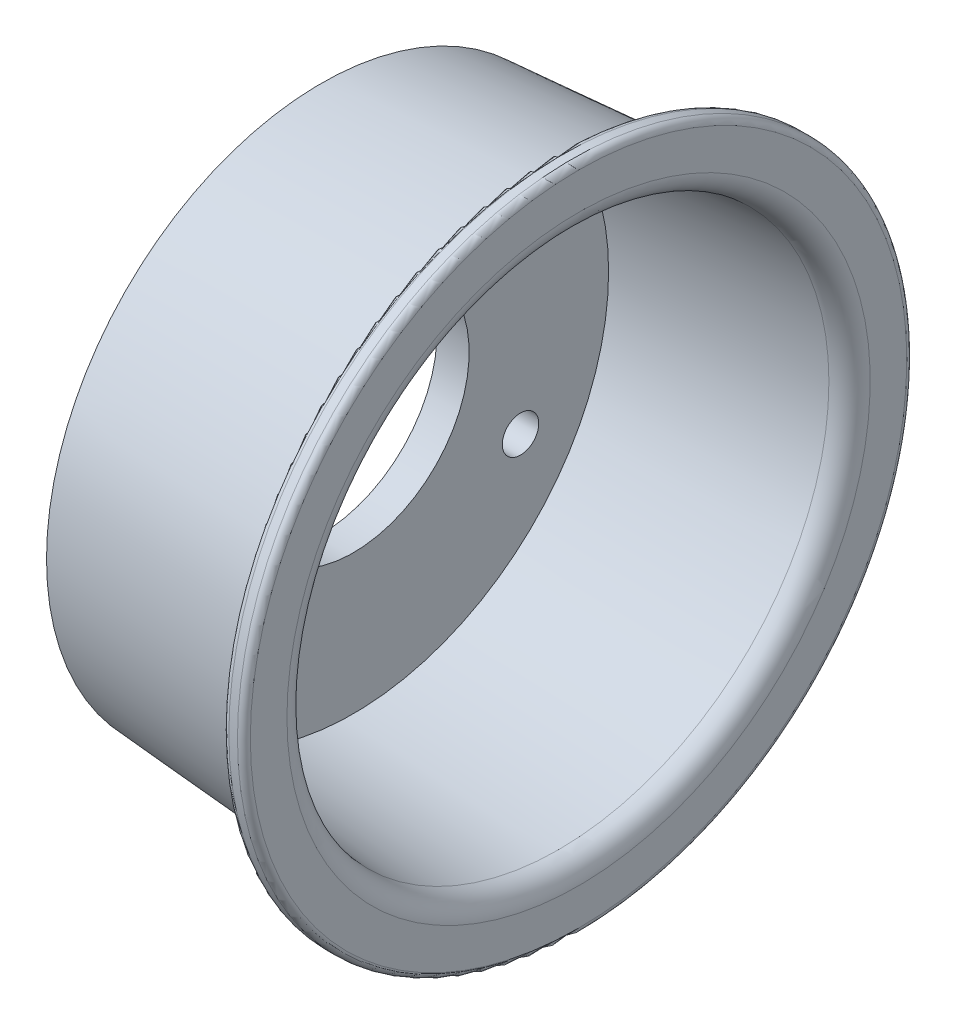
ISO-10303-21;
HEADER;
FILE_DESCRIPTION(('STEP AP214'),'2;1');
FILE_NAME('part.step','',(''),(''),'','','');
FILE_SCHEMA(('AUTOMOTIVE_DESIGN { 1 0 10303 214 1 1 1 1 }'));
ENDSEC;
DATA;
#1=APPLICATION_CONTEXT('core data for automotive mechanical design processes');
#2=APPLICATION_PROTOCOL_DEFINITION('international standard','automotive_design',2000,#1);
#3=PRODUCT_CONTEXT('',#1,'mechanical');
#4=PRODUCT('Part','Part','',(#3));
#5=PRODUCT_RELATED_PRODUCT_CATEGORY('part','',(#4));
#6=PRODUCT_DEFINITION_FORMATION('','',#4);
#7=PRODUCT_DEFINITION_CONTEXT('part definition',#1,'design');
#8=PRODUCT_DEFINITION('design','',#6,#7);
#9=PRODUCT_DEFINITION_SHAPE('','',#8);
#10=(LENGTH_UNIT() NAMED_UNIT(*) SI_UNIT(.MILLI.,.METRE.));
#11=(NAMED_UNIT(*) PLANE_ANGLE_UNIT() SI_UNIT($,.RADIAN.));
#12=(NAMED_UNIT(*) SI_UNIT($,.STERADIAN.) SOLID_ANGLE_UNIT());
#13=UNCERTAINTY_MEASURE_WITH_UNIT(LENGTH_MEASURE(1.E-05),#10,'distance_accuracy_value','');
#14=(GEOMETRIC_REPRESENTATION_CONTEXT(3) GLOBAL_UNCERTAINTY_ASSIGNED_CONTEXT((#13)) GLOBAL_UNIT_ASSIGNED_CONTEXT((#10,
#11,#12)) REPRESENTATION_CONTEXT('',''));
#15=CARTESIAN_POINT('',(0.,0.,0.));
#16=DIRECTION('',(0.,0.,1.));
#17=DIRECTION('',(1.,0.,0.));
#18=AXIS2_PLACEMENT_3D('',#15,#16,#17);
#19=CARTESIAN_POINT('',(-25.,-107.,0.));
#20=DIRECTION('',(-1.,0.,0.));
#21=DIRECTION('',(0.,0.,1.));
#22=AXIS2_PLACEMENT_3D('',#19,#20,#21);
#23=PLANE('',#22);
#24=CARTESIAN_POINT('',(-25.,-62.,-6.24500451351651E-13));
#25=DIRECTION('',(-1.,0.,0.));
#26=DIRECTION('',(0.,-0.866025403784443,-0.499999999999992));
#27=AXIS2_PLACEMENT_3D('',#24,#25,#26);
#28=CIRCLE('',#27,4.25000000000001);
#29=CARTESIAN_POINT('',(-25.,-65.6806079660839,-2.12500000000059));
#30=VERTEX_POINT('',#29);
#31=EDGE_CURVE('E66',#30,#30,#28,.T.);
#32=ORIENTED_EDGE('',*,*,#31,.F.);
#33=EDGE_LOOP('',(#32));
#34=FACE_BOUND('',#33,.T.);
#35=CARTESIAN_POINT('',(-25.,-129.5,38.9711431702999));
#36=DIRECTION('',(-1.,0.,0.));
#37=DIRECTION('',(0.,0.866025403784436,-0.500000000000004));
#38=AXIS2_PLACEMENT_3D('',#35,#36,#37);
#39=CIRCLE('',#38,4.25000000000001);
#40=CARTESIAN_POINT('',(-25.,-125.819392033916,36.8461431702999));
#41=VERTEX_POINT('',#40);
#42=EDGE_CURVE('E56',#41,#41,#39,.T.);
#43=ORIENTED_EDGE('',*,*,#42,.F.);
#44=EDGE_LOOP('',(#43));
#45=FACE_BOUND('',#44,.T.);
#46=CARTESIAN_POINT('',(-25.,-129.5,-38.9711431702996));
#47=DIRECTION('',(-1.,0.,0.));
#48=DIRECTION('',(0.,0.,1.));
#49=AXIS2_PLACEMENT_3D('',#46,#47,#48);
#50=CIRCLE('',#49,4.25000000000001);
#51=CARTESIAN_POINT('',(-25.,-129.5,-34.7211431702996));
#52=VERTEX_POINT('',#51);
#53=EDGE_CURVE('E53',#52,#52,#50,.T.);
#54=ORIENTED_EDGE('',*,*,#53,.F.);
#55=EDGE_LOOP('',(#54));
#56=FACE_BOUND('',#55,.T.);
#57=CARTESIAN_POINT('',(-25.,-107.,0.));
#58=DIRECTION('',(-1.,0.,0.));
#59=DIRECTION('',(0.,0.,1.));
#60=AXIS2_PLACEMENT_3D('',#57,#58,#59);
#61=CIRCLE('',#60,27.);
#62=CARTESIAN_POINT('',(-25.,-107.,27.));
#63=VERTEX_POINT('',#62);
#64=EDGE_CURVE('E50',#63,#63,#61,.T.);
#65=ORIENTED_EDGE('',*,*,#64,.F.);
#66=EDGE_LOOP('',(#65));
#67=FACE_BOUND('',#66,.T.);
#68=CARTESIAN_POINT('',(-25.,-107.,0.));
#69=DIRECTION('',(-1.,0.,0.));
#70=DIRECTION('',(0.,0.,1.));
#71=AXIS2_PLACEMENT_3D('',#68,#69,#70);
#72=CIRCLE('',#71,64.);
#73=CARTESIAN_POINT('',(-25.,-107.,64.));
#74=VERTEX_POINT('',#73);
#75=EDGE_CURVE('E10',#74,#74,#72,.T.);
#76=ORIENTED_EDGE('',*,*,#75,.T.);
#77=EDGE_LOOP('',(#76));
#78=FACE_BOUND('',#77,.T.);
#79=ADVANCED_FACE('F30',(#34,#45,#56,#67,#78),#23,.T.);
#80=CARTESIAN_POINT('',(-25.,-107.,0.));
#81=DIRECTION('',(1.,0.,0.));
#82=DIRECTION('',(0.,0.,-1.));
#83=AXIS2_PLACEMENT_3D('',#80,#81,#82);
#84=CONICAL_SURFACE('',#83,64.,0.0725994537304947);
#85=CARTESIAN_POINT('',(30.,-107.,0.));
#86=DIRECTION('',(-1.,0.,0.));
#87=DIRECTION('',(0.,0.,1.));
#88=AXIS2_PLACEMENT_3D('',#85,#86,#87);
#89=CIRCLE('',#88,68.);
#90=CARTESIAN_POINT('',(30.,-107.,68.));
#91=VERTEX_POINT('',#90);
#92=EDGE_CURVE('E37',#91,#91,#89,.T.);
#93=ORIENTED_EDGE('',*,*,#92,.T.);
#94=EDGE_LOOP('',(#93));
#95=FACE_BOUND('',#94,.T.);
#96=ORIENTED_EDGE('',*,*,#75,.F.);
#97=EDGE_LOOP('',(#96));
#98=FACE_BOUND('',#97,.T.);
#99=ADVANCED_FACE('F104',(#95,#98),#84,.T.);
#100=CARTESIAN_POINT('',(30.,-30.5,0.));
#101=DIRECTION('',(1.,0.,0.));
#102=DIRECTION('',(0.,0.,-1.));
#103=AXIS2_PLACEMENT_3D('',#100,#101,#102);
#104=PLANE('',#103);
#105=ORIENTED_EDGE('',*,*,#92,.F.);
#106=EDGE_LOOP('',(#105));
#107=FACE_BOUND('',#106,.T.);
#108=CARTESIAN_POINT('',(30.,-107.,0.));
#109=DIRECTION('',(-1.,0.,0.));
#110=DIRECTION('',(0.,0.,1.));
#111=AXIS2_PLACEMENT_3D('',#108,#109,#110);
#112=CIRCLE('',#111,76.5);
#113=CARTESIAN_POINT('',(30.,-107.,76.5));
#114=VERTEX_POINT('',#113);
#115=EDGE_CURVE('E42',#114,#114,#112,.T.);
#116=ORIENTED_EDGE('',*,*,#115,.T.);
#117=EDGE_LOOP('',(#116));
#118=FACE_BOUND('',#117,.T.);
#119=ADVANCED_FACE('F90',(#107,#118),#104,.F.);
#120=CARTESIAN_POINT('',(31.5,-107.,0.));
#121=DIRECTION('',(-1.,0.,0.));
#122=DIRECTION('',(0.,0.,1.));
#123=AXIS2_PLACEMENT_3D('',#120,#121,#122);
#124=TOROIDAL_SURFACE('',#123,76.5,1.5);
#125=CARTESIAN_POINT('',(31.5,-107.,0.));
#126=DIRECTION('',(-1.,0.,0.));
#127=DIRECTION('',(0.,0.,1.));
#128=AXIS2_PLACEMENT_3D('',#125,#126,#127);
#129=CIRCLE('',#128,78.);
#130=CARTESIAN_POINT('',(31.5,-107.,78.));
#131=VERTEX_POINT('',#130);
#132=EDGE_CURVE('E85',#131,#131,#129,.T.);
#133=ORIENTED_EDGE('',*,*,#132,.T.);
#134=EDGE_LOOP('',(#133));
#135=FACE_BOUND('',#134,.T.);
#136=ORIENTED_EDGE('',*,*,#115,.F.);
#137=EDGE_LOOP('',(#136));
#138=FACE_BOUND('',#137,.T.);
#139=ADVANCED_FACE('F92',(#135,#138),#124,.T.);
#140=CARTESIAN_POINT('',(-17.5,-107.,0.));
#141=DIRECTION('',(-1.,0.,0.));
#142=DIRECTION('',(0.,0.,1.));
#143=AXIS2_PLACEMENT_3D('',#140,#141,#142);
#144=CYLINDRICAL_SURFACE('',#143,78.);
#145=ORIENTED_EDGE('',*,*,#132,.F.);
#146=EDGE_LOOP('',(#145));
#147=FACE_BOUND('',#146,.T.);
#148=CARTESIAN_POINT('',(33.5,-107.,0.));
#149=DIRECTION('',(-1.,0.,0.));
#150=DIRECTION('',(0.,0.,1.));
#151=AXIS2_PLACEMENT_3D('',#148,#149,#150);
#152=CIRCLE('',#151,78.);
#153=CARTESIAN_POINT('',(33.5,-107.,78.));
#154=VERTEX_POINT('',#153);
#155=EDGE_CURVE('E82',#154,#154,#152,.T.);
#156=ORIENTED_EDGE('',*,*,#155,.T.);
#157=EDGE_LOOP('',(#156));
#158=FACE_BOUND('',#157,.T.);
#159=ADVANCED_FACE('F94',(#147,#158),#144,.T.);
#160=CARTESIAN_POINT('',(33.5,-107.,0.));
#161=DIRECTION('',(-1.,0.,0.));
#162=DIRECTION('',(0.,0.,1.));
#163=AXIS2_PLACEMENT_3D('',#160,#161,#162);
#164=TOROIDAL_SURFACE('',#163,76.5,1.5);
#165=ORIENTED_EDGE('',*,*,#155,.F.);
#166=EDGE_LOOP('',(#165));
#167=FACE_BOUND('',#166,.T.);
#168=CARTESIAN_POINT('',(35.,-107.,0.));
#169=DIRECTION('',(-1.,0.,0.));
#170=DIRECTION('',(0.,0.,1.));
#171=AXIS2_PLACEMENT_3D('',#168,#169,#170);
#172=CIRCLE('',#171,76.5);
#173=CARTESIAN_POINT('',(35.,-107.,76.5));
#174=VERTEX_POINT('',#173);
#175=EDGE_CURVE('E79',#174,#174,#172,.T.);
#176=ORIENTED_EDGE('',*,*,#175,.T.);
#177=EDGE_LOOP('',(#176));
#178=FACE_BOUND('',#177,.T.);
#179=ADVANCED_FACE('F101',(#167,#178),#164,.T.);
#180=CARTESIAN_POINT('',(35.,-39.,0.));
#181=DIRECTION('',(1.,0.,0.));
#182=DIRECTION('',(0.,0.,-1.));
#183=AXIS2_PLACEMENT_3D('',#180,#181,#182);
#184=PLANE('',#183);
#185=CARTESIAN_POINT('',(35.,-107.,0.));
#186=DIRECTION('',(-1.,0.,0.));
#187=DIRECTION('',(0.,0.,1.));
#188=AXIS2_PLACEMENT_3D('',#185,#186,#187);
#189=CIRCLE('',#188,67.9677511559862);
#190=CARTESIAN_POINT('',(35.,-107.,67.9677511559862));
#191=VERTEX_POINT('',#190);
#192=EDGE_CURVE('E76',#191,#191,#189,.T.);
#193=ORIENTED_EDGE('',*,*,#192,.T.);
#194=EDGE_LOOP('',(#193));
#195=FACE_BOUND('',#194,.T.);
#196=ORIENTED_EDGE('',*,*,#175,.F.);
#197=EDGE_LOOP('',(#196));
#198=FACE_BOUND('',#197,.T.);
#199=ADVANCED_FACE('F143',(#195,#198),#184,.T.);
#200=CARTESIAN_POINT('',(30.,-107.,0.));
#201=DIRECTION('',(-1.,0.,0.));
#202=DIRECTION('',(0.,0.,1.));
#203=AXIS2_PLACEMENT_3D('',#200,#201,#202);
#204=TOROIDAL_SURFACE('',#203,67.9677511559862,5.);
#205=CARTESIAN_POINT('',(30.3626784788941,-107.,0.));
#206=DIRECTION('',(-1.,0.,0.));
#207=DIRECTION('',(0.,0.,1.));
#208=AXIS2_PLACEMENT_3D('',#205,#206,#207);
#209=CIRCLE('',#208,62.9809220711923);
#210=CARTESIAN_POINT('',(30.3626784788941,-107.,62.9809220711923));
#211=VERTEX_POINT('',#210);
#212=EDGE_CURVE('E73',#211,#211,#209,.T.);
#213=ORIENTED_EDGE('',*,*,#212,.T.);
#214=EDGE_LOOP('',(#213));
#215=FACE_BOUND('',#214,.T.);
#216=ORIENTED_EDGE('',*,*,#192,.F.);
#217=EDGE_LOOP('',(#216));
#218=FACE_BOUND('',#217,.T.);
#219=ADVANCED_FACE('F137',(#215,#218),#204,.T.);
#220=CARTESIAN_POINT('',(-17.5,-107.,0.));
#221=DIRECTION('',(1.,0.,0.));
#222=DIRECTION('',(0.,0.,-1.));
#223=AXIS2_PLACEMENT_3D('',#220,#221,#222);
#224=CONICAL_SURFACE('',#223,59.5,0.0725994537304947);
#225=ORIENTED_EDGE('',*,*,#212,.F.);
#226=EDGE_LOOP('',(#225));
#227=FACE_BOUND('',#226,.T.);
#228=CARTESIAN_POINT('',(-17.5,-107.,0.));
#229=DIRECTION('',(-1.,0.,0.));
#230=DIRECTION('',(0.,0.,1.));
#231=AXIS2_PLACEMENT_3D('',#228,#229,#230);
#232=CIRCLE('',#231,59.5);
#233=CARTESIAN_POINT('',(-17.5,-107.,59.5));
#234=VERTEX_POINT('',#233);
#235=EDGE_CURVE('E49',#234,#234,#232,.T.);
#236=ORIENTED_EDGE('',*,*,#235,.T.);
#237=EDGE_LOOP('',(#236));
#238=FACE_BOUND('',#237,.T.);
#239=ADVANCED_FACE('F131',(#227,#238),#224,.F.);
#240=CARTESIAN_POINT('',(-17.5,-107.,0.));
#241=DIRECTION('',(-1.,0.,0.));
#242=DIRECTION('',(0.,0.,1.));
#243=AXIS2_PLACEMENT_3D('',#240,#241,#242);
#244=PLANE('',#243);
#245=CARTESIAN_POINT('',(-17.5,-62.,-6.24500451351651E-13));
#246=DIRECTION('',(-1.,0.,0.));
#247=DIRECTION('',(0.,0.,1.));
#248=AXIS2_PLACEMENT_3D('',#245,#246,#247);
#249=CIRCLE('',#248,4.25000000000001);
#250=CARTESIAN_POINT('',(-17.5,-62.,4.24999999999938));
#251=VERTEX_POINT('',#250);
#252=EDGE_CURVE('E33',#251,#251,#249,.T.);
#253=ORIENTED_EDGE('',*,*,#252,.T.);
#254=EDGE_LOOP('',(#253));
#255=FACE_BOUND('',#254,.T.);
#256=CARTESIAN_POINT('',(-17.5,-129.5,38.9711431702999));
#257=DIRECTION('',(-1.,0.,0.));
#258=DIRECTION('',(0.,0.,1.));
#259=AXIS2_PLACEMENT_3D('',#256,#257,#258);
#260=CIRCLE('',#259,4.25000000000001);
#261=CARTESIAN_POINT('',(-17.5,-129.5,43.2211431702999));
#262=VERTEX_POINT('',#261);
#263=EDGE_CURVE('E54',#262,#262,#260,.T.);
#264=ORIENTED_EDGE('',*,*,#263,.T.);
#265=EDGE_LOOP('',(#264));
#266=FACE_BOUND('',#265,.T.);
#267=CARTESIAN_POINT('',(-17.5,-129.5,-38.9711431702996));
#268=DIRECTION('',(-1.,0.,0.));
#269=DIRECTION('',(0.,0.,1.));
#270=AXIS2_PLACEMENT_3D('',#267,#268,#269);
#271=CIRCLE('',#270,4.25000000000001);
#272=CARTESIAN_POINT('',(-17.5,-129.5,-34.7211431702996));
#273=VERTEX_POINT('',#272);
#274=EDGE_CURVE('E51',#273,#273,#271,.T.);
#275=ORIENTED_EDGE('',*,*,#274,.T.);
#276=EDGE_LOOP('',(#275));
#277=FACE_BOUND('',#276,.T.);
#278=CARTESIAN_POINT('',(-17.5,-107.,0.));
#279=DIRECTION('',(-1.,0.,0.));
#280=DIRECTION('',(0.,0.,1.));
#281=AXIS2_PLACEMENT_3D('',#278,#279,#280);
#282=CIRCLE('',#281,27.);
#283=CARTESIAN_POINT('',(-17.5,-107.,27.));
#284=VERTEX_POINT('',#283);
#285=EDGE_CURVE('E46',#284,#284,#282,.T.);
#286=ORIENTED_EDGE('',*,*,#285,.T.);
#287=EDGE_LOOP('',(#286));
#288=FACE_BOUND('',#287,.T.);
#289=ORIENTED_EDGE('',*,*,#235,.F.);
#290=EDGE_LOOP('',(#289));
#291=FACE_BOUND('',#290,.T.);
#292=ADVANCED_FACE('F125',(#255,#266,#277,#288,#291),#244,.F.);
#293=CARTESIAN_POINT('',(35.,-107.,0.));
#294=DIRECTION('',(-1.,0.,0.));
#295=DIRECTION('',(0.,0.,1.));
#296=AXIS2_PLACEMENT_3D('',#293,#294,#295);
#297=CYLINDRICAL_SURFACE('',#296,27.);
#298=ORIENTED_EDGE('',*,*,#64,.T.);
#299=EDGE_LOOP('',(#298));
#300=FACE_BOUND('',#299,.T.);
#301=ORIENTED_EDGE('',*,*,#285,.F.);
#302=EDGE_LOOP('',(#301));
#303=FACE_BOUND('',#302,.T.);
#304=ADVANCED_FACE('F121',(#300,#303),#297,.F.);
#305=CARTESIAN_POINT('',(35.,-129.5,-38.9711431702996));
#306=DIRECTION('',(-1.,0.,0.));
#307=DIRECTION('',(0.,0.,1.));
#308=AXIS2_PLACEMENT_3D('',#305,#306,#307);
#309=CYLINDRICAL_SURFACE('',#308,4.25000000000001);
#310=ORIENTED_EDGE('',*,*,#53,.T.);
#311=EDGE_LOOP('',(#310));
#312=FACE_BOUND('',#311,.T.);
#313=ORIENTED_EDGE('',*,*,#274,.F.);
#314=EDGE_LOOP('',(#313));
#315=FACE_BOUND('',#314,.T.);
#316=ADVANCED_FACE('F124',(#312,#315),#309,.F.);
#317=CARTESIAN_POINT('',(35.,-129.5,38.9711431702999));
#318=DIRECTION('',(-1.,0.,0.));
#319=DIRECTION('',(0.,0.,1.));
#320=AXIS2_PLACEMENT_3D('',#317,#318,#319);
#321=CYLINDRICAL_SURFACE('',#320,4.25000000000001);
#322=ORIENTED_EDGE('',*,*,#42,.T.);
#323=EDGE_LOOP('',(#322));
#324=FACE_BOUND('',#323,.T.);
#325=ORIENTED_EDGE('',*,*,#263,.F.);
#326=EDGE_LOOP('',(#325));
#327=FACE_BOUND('',#326,.T.);
#328=ADVANCED_FACE('F195',(#324,#327),#321,.F.);
#329=CARTESIAN_POINT('',(35.,-62.,-6.24500451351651E-13));
#330=DIRECTION('',(-1.,0.,0.));
#331=DIRECTION('',(0.,0.,1.));
#332=AXIS2_PLACEMENT_3D('',#329,#330,#331);
#333=CYLINDRICAL_SURFACE('',#332,4.25000000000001);
#334=ORIENTED_EDGE('',*,*,#31,.T.);
#335=EDGE_LOOP('',(#334));
#336=FACE_BOUND('',#335,.T.);
#337=ORIENTED_EDGE('',*,*,#252,.F.);
#338=EDGE_LOOP('',(#337));
#339=FACE_BOUND('',#338,.T.);
#340=ADVANCED_FACE('F205',(#336,#339),#333,.F.);
#341=CLOSED_SHELL('',(#79,#99,#119,#139,#159,#179,#199,#219,#239,#292,#304,#316,#328,#340));
#342=MANIFOLD_SOLID_BREP('B2',#341);
#343=ADVANCED_BREP_SHAPE_REPRESENTATION('',(#18,#342),#14);
#344=SHAPE_DEFINITION_REPRESENTATION(#9,#343);
ENDSEC;
END-ISO-10303-21;
